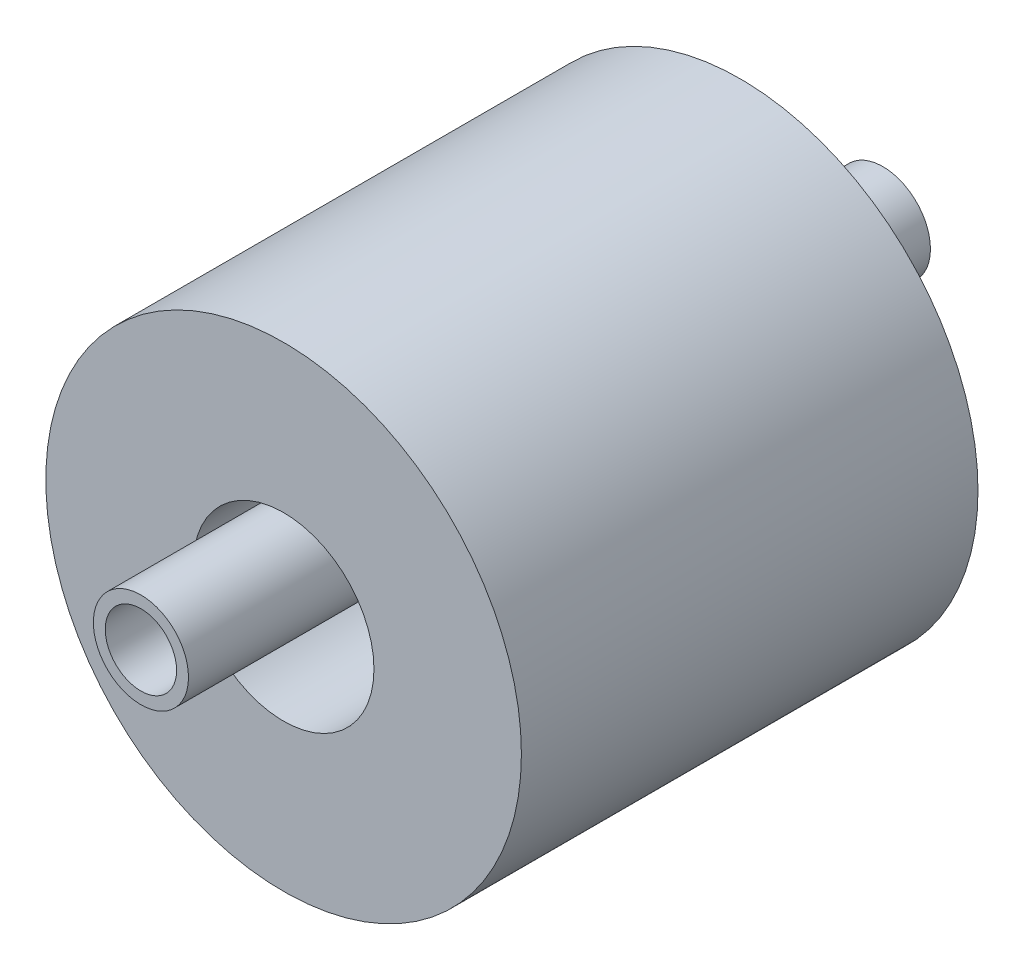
ISO-10303-21;
HEADER;
FILE_DESCRIPTION(('STEP AP214'),'2;1');
FILE_NAME('part.step','',(''),(''),'','','');
FILE_SCHEMA(('AUTOMOTIVE_DESIGN { 1 0 10303 214 1 1 1 1 }'));
ENDSEC;
DATA;
#1=APPLICATION_CONTEXT('core data for automotive mechanical design processes');
#2=APPLICATION_PROTOCOL_DEFINITION('international standard','automotive_design',2000,#1);
#3=PRODUCT_CONTEXT('',#1,'mechanical');
#4=PRODUCT('Part','Part','',(#3));
#5=PRODUCT_RELATED_PRODUCT_CATEGORY('part','',(#4));
#6=PRODUCT_DEFINITION_FORMATION('','',#4);
#7=PRODUCT_DEFINITION_CONTEXT('part definition',#1,'design');
#8=PRODUCT_DEFINITION('design','',#6,#7);
#9=PRODUCT_DEFINITION_SHAPE('','',#8);
#10=(LENGTH_UNIT() NAMED_UNIT(*) SI_UNIT(.MILLI.,.METRE.));
#11=(NAMED_UNIT(*) PLANE_ANGLE_UNIT() SI_UNIT($,.RADIAN.));
#12=(NAMED_UNIT(*) SI_UNIT($,.STERADIAN.) SOLID_ANGLE_UNIT());
#13=UNCERTAINTY_MEASURE_WITH_UNIT(LENGTH_MEASURE(1.E-05),#10,'distance_accuracy_value','');
#14=(GEOMETRIC_REPRESENTATION_CONTEXT(3) GLOBAL_UNCERTAINTY_ASSIGNED_CONTEXT((#13)) GLOBAL_UNIT_ASSIGNED_CONTEXT((#10,
#11,#12)) REPRESENTATION_CONTEXT('',''));
#15=CARTESIAN_POINT('',(0.,0.,0.));
#16=DIRECTION('',(0.,0.,1.));
#17=DIRECTION('',(1.,0.,0.));
#18=AXIS2_PLACEMENT_3D('',#15,#16,#17);
#19=CARTESIAN_POINT('',(0.,9.,126.));
#20=DIRECTION('',(0.,0.,1.));
#21=DIRECTION('',(1.,0.,0.));
#22=AXIS2_PLACEMENT_3D('',#19,#20,#21);
#23=PLANE('',#22);
#24=CARTESIAN_POINT('',(0.,9.,126.));
#25=DIRECTION('',(0.,0.,1.));
#26=DIRECTION('',(1.,0.,0.));
#27=AXIS2_PLACEMENT_3D('',#24,#25,#26);
#28=CIRCLE('',#27,10.);
#29=CARTESIAN_POINT('',(10.,9.,126.));
#30=VERTEX_POINT('',#29);
#31=EDGE_CURVE('E11',#30,#30,#28,.T.);
#32=ORIENTED_EDGE('',*,*,#31,.T.);
#33=EDGE_LOOP('',(#32));
#34=FACE_BOUND('',#33,.T.);
#35=CARTESIAN_POINT('',(0.,9.,126.));
#36=DIRECTION('',(0.,0.,1.));
#37=DIRECTION('',(1.,0.,0.));
#38=AXIS2_PLACEMENT_3D('',#35,#36,#37);
#39=CIRCLE('',#38,7.5);
#40=CARTESIAN_POINT('',(7.5,9.,126.));
#41=VERTEX_POINT('',#40);
#42=EDGE_CURVE('E52',#41,#41,#39,.T.);
#43=ORIENTED_EDGE('',*,*,#42,.F.);
#44=EDGE_LOOP('',(#43));
#45=FACE_BOUND('',#44,.T.);
#46=ADVANCED_FACE('F45',(#34,#45),#23,.T.);
#47=CARTESIAN_POINT('',(0.,9.,126.));
#48=DIRECTION('',(0.,0.,-1.));
#49=DIRECTION('',(-1.,0.,0.));
#50=AXIS2_PLACEMENT_3D('',#47,#48,#49);
#51=CYLINDRICAL_SURFACE('',#50,10.);
#52=ORIENTED_EDGE('',*,*,#31,.F.);
#53=EDGE_LOOP('',(#52));
#54=FACE_BOUND('',#53,.T.);
#55=CARTESIAN_POINT('',(0.,9.,-30.));
#56=DIRECTION('',(0.,0.,1.));
#57=DIRECTION('',(1.,0.,0.));
#58=AXIS2_PLACEMENT_3D('',#55,#56,#57);
#59=CIRCLE('',#58,10.);
#60=CARTESIAN_POINT('',(10.,9.,-30.));
#61=VERTEX_POINT('',#60);
#62=EDGE_CURVE('E56',#61,#61,#59,.T.);
#63=ORIENTED_EDGE('',*,*,#62,.T.);
#64=EDGE_LOOP('',(#63));
#65=FACE_BOUND('',#64,.T.);
#66=ADVANCED_FACE('F47',(#54,#65),#51,.T.);
#67=CARTESIAN_POINT('',(0.,9.,126.));
#68=DIRECTION('',(0.,0.,-1.));
#69=DIRECTION('',(-1.,0.,0.));
#70=AXIS2_PLACEMENT_3D('',#67,#68,#69);
#71=CYLINDRICAL_SURFACE('',#70,7.5);
#72=ORIENTED_EDGE('',*,*,#42,.T.);
#73=EDGE_LOOP('',(#72));
#74=FACE_BOUND('',#73,.T.);
#75=CARTESIAN_POINT('',(0.,9.,-30.));
#76=DIRECTION('',(0.,0.,1.));
#77=DIRECTION('',(1.,0.,0.));
#78=AXIS2_PLACEMENT_3D('',#75,#76,#77);
#79=CIRCLE('',#78,7.5);
#80=CARTESIAN_POINT('',(7.5,9.,-30.));
#81=VERTEX_POINT('',#80);
#82=EDGE_CURVE('E60',#81,#81,#79,.T.);
#83=ORIENTED_EDGE('',*,*,#82,.F.);
#84=EDGE_LOOP('',(#83));
#85=FACE_BOUND('',#84,.T.);
#86=ADVANCED_FACE('F69',(#74,#85),#71,.F.);
#87=CARTESIAN_POINT('',(0.,9.,-30.));
#88=DIRECTION('',(0.,0.,1.));
#89=DIRECTION('',(1.,0.,0.));
#90=AXIS2_PLACEMENT_3D('',#87,#88,#89);
#91=PLANE('',#90);
#92=ORIENTED_EDGE('',*,*,#82,.T.);
#93=EDGE_LOOP('',(#92));
#94=FACE_BOUND('',#93,.T.);
#95=ORIENTED_EDGE('',*,*,#62,.F.);
#96=EDGE_LOOP('',(#95));
#97=FACE_BOUND('',#96,.T.);
#98=ADVANCED_FACE('F66',(#94,#97),#91,.F.);
#99=CLOSED_SHELL('',(#46,#66,#86,#98));
#100=MANIFOLD_SOLID_BREP('B2',#99);
#101=CARTESIAN_POINT('',(0.,0.,96.));
#102=DIRECTION('',(0.,0.,1.));
#103=DIRECTION('',(1.,0.,0.));
#104=AXIS2_PLACEMENT_3D('',#101,#102,#103);
#105=PLANE('',#104);
#106=CARTESIAN_POINT('',(0.,0.,96.));
#107=DIRECTION('',(0.,0.,1.));
#108=DIRECTION('',(1.,0.,0.));
#109=AXIS2_PLACEMENT_3D('',#106,#107,#108);
#110=CIRCLE('',#109,50.);
#111=CARTESIAN_POINT('',(50.,0.,96.));
#112=VERTEX_POINT('',#111);
#113=EDGE_CURVE('E44',#112,#112,#110,.T.);
#114=ORIENTED_EDGE('',*,*,#113,.T.);
#115=EDGE_LOOP('',(#114));
#116=FACE_BOUND('',#115,.T.);
#117=CARTESIAN_POINT('',(0.,0.,96.));
#118=DIRECTION('',(0.,0.,1.));
#119=DIRECTION('',(1.,0.,0.));
#120=AXIS2_PLACEMENT_3D('',#117,#118,#119);
#121=CIRCLE('',#120,19.);
#122=CARTESIAN_POINT('',(19.,0.,96.));
#123=VERTEX_POINT('',#122);
#124=EDGE_CURVE('E120',#123,#123,#121,.T.);
#125=ORIENTED_EDGE('',*,*,#124,.F.);
#126=EDGE_LOOP('',(#125));
#127=FACE_BOUND('',#126,.T.);
#128=ADVANCED_FACE('F107',(#116,#127),#105,.T.);
#129=CARTESIAN_POINT('',(0.,0.,0.));
#130=DIRECTION('',(0.,0.,1.));
#131=DIRECTION('',(1.,0.,0.));
#132=AXIS2_PLACEMENT_3D('',#129,#130,#131);
#133=PLANE('',#132);
#134=CARTESIAN_POINT('',(0.,0.,0.));
#135=DIRECTION('',(0.,0.,1.));
#136=DIRECTION('',(1.,0.,0.));
#137=AXIS2_PLACEMENT_3D('',#134,#135,#136);
#138=CIRCLE('',#137,50.);
#139=CARTESIAN_POINT('',(50.,0.,0.));
#140=VERTEX_POINT('',#139);
#141=EDGE_CURVE('E111',#140,#140,#138,.T.);
#142=ORIENTED_EDGE('',*,*,#141,.F.);
#143=EDGE_LOOP('',(#142));
#144=FACE_BOUND('',#143,.T.);
#145=CARTESIAN_POINT('',(0.,0.,0.));
#146=DIRECTION('',(0.,0.,1.));
#147=DIRECTION('',(1.,0.,0.));
#148=AXIS2_PLACEMENT_3D('',#145,#146,#147);
#149=CIRCLE('',#148,19.);
#150=CARTESIAN_POINT('',(19.,0.,0.));
#151=VERTEX_POINT('',#150);
#152=EDGE_CURVE('E122',#151,#151,#149,.T.);
#153=ORIENTED_EDGE('',*,*,#152,.T.);
#154=EDGE_LOOP('',(#153));
#155=FACE_BOUND('',#154,.T.);
#156=ADVANCED_FACE('F133',(#144,#155),#133,.F.);
#157=CARTESIAN_POINT('',(0.,0.,96.));
#158=DIRECTION('',(0.,0.,-1.));
#159=DIRECTION('',(-1.,0.,0.));
#160=AXIS2_PLACEMENT_3D('',#157,#158,#159);
#161=CYLINDRICAL_SURFACE('',#160,50.);
#162=ORIENTED_EDGE('',*,*,#113,.F.);
#163=EDGE_LOOP('',(#162));
#164=FACE_BOUND('',#163,.T.);
#165=ORIENTED_EDGE('',*,*,#141,.T.);
#166=EDGE_LOOP('',(#165));
#167=FACE_BOUND('',#166,.T.);
#168=ADVANCED_FACE('F109',(#164,#167),#161,.T.);
#169=CARTESIAN_POINT('',(0.,0.,96.));
#170=DIRECTION('',(0.,0.,-1.));
#171=DIRECTION('',(-1.,0.,0.));
#172=AXIS2_PLACEMENT_3D('',#169,#170,#171);
#173=CYLINDRICAL_SURFACE('',#172,19.);
#174=ORIENTED_EDGE('',*,*,#152,.F.);
#175=EDGE_LOOP('',(#174));
#176=FACE_BOUND('',#175,.T.);
#177=ORIENTED_EDGE('',*,*,#124,.T.);
#178=EDGE_LOOP('',(#177));
#179=FACE_BOUND('',#178,.T.);
#180=ADVANCED_FACE('F130',(#176,#179),#173,.F.);
#181=CLOSED_SHELL('',(#128,#156,#168,#180));
#182=MANIFOLD_SOLID_BREP('B6',#181);
#183=ADVANCED_BREP_SHAPE_REPRESENTATION('',(#18,#100,#182),#14);
#184=SHAPE_DEFINITION_REPRESENTATION(#9,#183);
ENDSEC;
END-ISO-10303-21;
